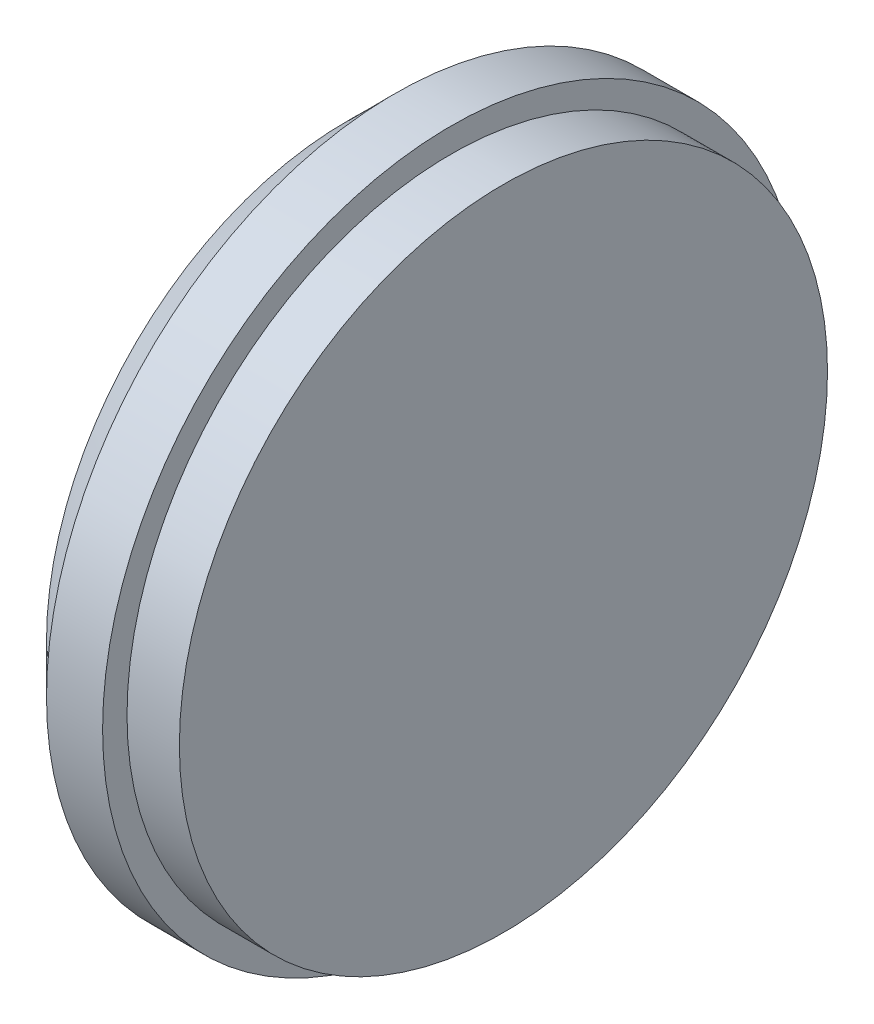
ISO-10303-21;
HEADER;
FILE_DESCRIPTION(('STEP AP214'),'2;1');
FILE_NAME('part.step','',(''),(''),'','','');
FILE_SCHEMA(('AUTOMOTIVE_DESIGN { 1 0 10303 214 1 1 1 1 }'));
ENDSEC;
DATA;
#1=APPLICATION_CONTEXT('core data for automotive mechanical design processes');
#2=APPLICATION_PROTOCOL_DEFINITION('international standard','automotive_design',2000,#1);
#3=PRODUCT_CONTEXT('',#1,'mechanical');
#4=PRODUCT('Part','Part','',(#3));
#5=PRODUCT_RELATED_PRODUCT_CATEGORY('part','',(#4));
#6=PRODUCT_DEFINITION_FORMATION('','',#4);
#7=PRODUCT_DEFINITION_CONTEXT('part definition',#1,'design');
#8=PRODUCT_DEFINITION('design','',#6,#7);
#9=PRODUCT_DEFINITION_SHAPE('','',#8);
#10=(LENGTH_UNIT() NAMED_UNIT(*) SI_UNIT(.MILLI.,.METRE.));
#11=(NAMED_UNIT(*) PLANE_ANGLE_UNIT() SI_UNIT($,.RADIAN.));
#12=(NAMED_UNIT(*) SI_UNIT($,.STERADIAN.) SOLID_ANGLE_UNIT());
#13=UNCERTAINTY_MEASURE_WITH_UNIT(LENGTH_MEASURE(1.E-05),#10,'distance_accuracy_value','');
#14=(GEOMETRIC_REPRESENTATION_CONTEXT(3) GLOBAL_UNCERTAINTY_ASSIGNED_CONTEXT((#13)) GLOBAL_UNIT_ASSIGNED_CONTEXT((#10,
#11,#12)) REPRESENTATION_CONTEXT('',''));
#15=CARTESIAN_POINT('',(0.,0.,0.));
#16=DIRECTION('',(0.,0.,1.));
#17=DIRECTION('',(1.,0.,0.));
#18=AXIS2_PLACEMENT_3D('',#15,#16,#17);
#19=CARTESIAN_POINT('',(-6.34745999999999,31.34106,0.));
#20=DIRECTION('',(1.,0.,0.));
#21=DIRECTION('',(0.,0.,-1.));
#22=AXIS2_PLACEMENT_3D('',#19,#20,#21);
#23=PLANE('',#22);
#24=CARTESIAN_POINT('',(-6.34745999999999,31.34106,0.));
#25=DIRECTION('',(-1.,0.,0.));
#26=DIRECTION('',(0.,0.,1.));
#27=AXIS2_PLACEMENT_3D('',#24,#25,#26);
#28=CIRCLE('',#27,34.3916);
#29=CARTESIAN_POINT('',(-6.34745999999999,31.34106,34.3916));
#30=VERTEX_POINT('',#29);
#31=EDGE_CURVE('E10',#30,#30,#28,.T.);
#32=ORIENTED_EDGE('',*,*,#31,.F.);
#33=EDGE_LOOP('',(#32));
#34=FACE_BOUND('',#33,.T.);
#35=ADVANCED_FACE('F31',(#34),#23,.T.);
#36=CARTESIAN_POINT('',(-23.01748,31.34106,0.));
#37=DIRECTION('',(-1.,0.,0.));
#38=DIRECTION('',(0.,0.,1.));
#39=AXIS2_PLACEMENT_3D('',#36,#37,#38);
#40=CYLINDRICAL_SURFACE('',#39,34.3916);
#41=ORIENTED_EDGE('',*,*,#31,.T.);
#42=EDGE_LOOP('',(#41));
#43=FACE_BOUND('',#42,.T.);
#44=CARTESIAN_POINT('',(-11.90498,31.34106,0.));
#45=DIRECTION('',(-1.,0.,0.));
#46=DIRECTION('',(0.,0.,1.));
#47=AXIS2_PLACEMENT_3D('',#44,#45,#46);
#48=CIRCLE('',#47,34.3916);
#49=CARTESIAN_POINT('',(-11.90498,31.34106,34.3916));
#50=VERTEX_POINT('',#49);
#51=EDGE_CURVE('E37',#50,#50,#48,.T.);
#52=ORIENTED_EDGE('',*,*,#51,.F.);
#53=EDGE_LOOP('',(#52));
#54=FACE_BOUND('',#53,.T.);
#55=ADVANCED_FACE('F70',(#43,#54),#40,.T.);
#56=CARTESIAN_POINT('',(-11.90498,-3.05053999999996,0.));
#57=DIRECTION('',(1.,0.,0.));
#58=DIRECTION('',(0.,0.,-1.));
#59=AXIS2_PLACEMENT_3D('',#56,#57,#58);
#60=PLANE('',#59);
#61=ORIENTED_EDGE('',*,*,#51,.T.);
#62=EDGE_LOOP('',(#61));
#63=FACE_BOUND('',#62,.T.);
#64=CARTESIAN_POINT('',(-11.90498,31.34106,0.));
#65=DIRECTION('',(-1.,0.,0.));
#66=DIRECTION('',(0.,0.,1.));
#67=AXIS2_PLACEMENT_3D('',#64,#65,#66);
#68=CIRCLE('',#67,36.9824);
#69=CARTESIAN_POINT('',(-11.90498,31.34106,36.9824));
#70=VERTEX_POINT('',#69);
#71=EDGE_CURVE('E41',#70,#70,#68,.T.);
#72=ORIENTED_EDGE('',*,*,#71,.F.);
#73=EDGE_LOOP('',(#72));
#74=FACE_BOUND('',#73,.T.);
#75=ADVANCED_FACE('F66',(#63,#74),#60,.T.);
#76=CARTESIAN_POINT('',(-23.01748,31.34106,0.));
#77=DIRECTION('',(-1.,0.,0.));
#78=DIRECTION('',(0.,0.,1.));
#79=AXIS2_PLACEMENT_3D('',#76,#77,#78);
#80=CYLINDRICAL_SURFACE('',#79,36.9824);
#81=ORIENTED_EDGE('',*,*,#71,.T.);
#82=EDGE_LOOP('',(#81));
#83=FACE_BOUND('',#82,.T.);
#84=CARTESIAN_POINT('',(-17.85874,31.34106,0.));
#85=DIRECTION('',(-1.,0.,0.));
#86=DIRECTION('',(0.,0.,1.));
#87=AXIS2_PLACEMENT_3D('',#84,#85,#86);
#88=CIRCLE('',#87,36.9824);
#89=CARTESIAN_POINT('',(-17.85874,31.34106,36.9824));
#90=VERTEX_POINT('',#89);
#91=EDGE_CURVE('E45',#90,#90,#88,.T.);
#92=ORIENTED_EDGE('',*,*,#91,.F.);
#93=EDGE_LOOP('',(#92));
#94=FACE_BOUND('',#93,.T.);
#95=ADVANCED_FACE('F58',(#83,#94),#80,.T.);
#96=CARTESIAN_POINT('',(-23.01748,31.34106,0.));
#97=DIRECTION('',(1.,0.,0.));
#98=DIRECTION('',(0.,0.,-1.));
#99=AXIS2_PLACEMENT_3D('',#96,#97,#98);
#100=CONICAL_SURFACE('',#99,31.82366,0.785398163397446);
#101=ORIENTED_EDGE('',*,*,#91,.T.);
#102=EDGE_LOOP('',(#101));
#103=FACE_BOUND('',#102,.T.);
#104=CARTESIAN_POINT('',(-23.01748,31.34106,0.));
#105=DIRECTION('',(-1.,0.,0.));
#106=DIRECTION('',(0.,0.,1.));
#107=AXIS2_PLACEMENT_3D('',#104,#105,#106);
#108=CIRCLE('',#107,31.82366);
#109=CARTESIAN_POINT('',(-23.01748,31.34106,31.82366));
#110=VERTEX_POINT('',#109);
#111=EDGE_CURVE('E50',#110,#110,#108,.T.);
#112=ORIENTED_EDGE('',*,*,#111,.F.);
#113=EDGE_LOOP('',(#112));
#114=FACE_BOUND('',#113,.T.);
#115=ADVANCED_FACE('F56',(#103,#114),#100,.T.);
#116=CARTESIAN_POINT('',(-23.01748,-0.482599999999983,0.));
#117=DIRECTION('',(-1.,0.,0.));
#118=DIRECTION('',(0.,0.,1.));
#119=AXIS2_PLACEMENT_3D('',#116,#117,#118);
#120=PLANE('',#119);
#121=ORIENTED_EDGE('',*,*,#111,.T.);
#122=EDGE_LOOP('',(#121));
#123=FACE_BOUND('',#122,.T.);
#124=ADVANCED_FACE('F54',(#123),#120,.T.);
#125=CLOSED_SHELL('',(#35,#55,#75,#95,#115,#124));
#126=MANIFOLD_SOLID_BREP('B2',#125);
#127=ADVANCED_BREP_SHAPE_REPRESENTATION('',(#18,#126),#14);
#128=SHAPE_DEFINITION_REPRESENTATION(#9,#127);
ENDSEC;
END-ISO-10303-21;
